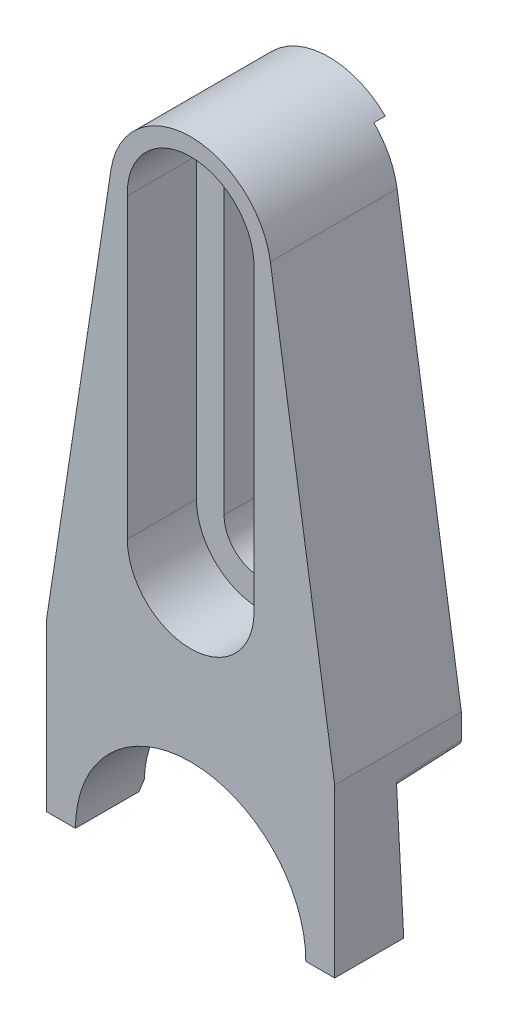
ISO-10303-21;
HEADER;
FILE_DESCRIPTION(('STEP AP214'),'2;1');
FILE_NAME('part.step','',(''),(''),'','','');
FILE_SCHEMA(('AUTOMOTIVE_DESIGN { 1 0 10303 214 1 1 1 1 }'));
ENDSEC;
DATA;
#1=APPLICATION_CONTEXT('core data for automotive mechanical design processes');
#2=APPLICATION_PROTOCOL_DEFINITION('international standard','automotive_design',2000,#1);
#3=PRODUCT_CONTEXT('',#1,'mechanical');
#4=PRODUCT('Part','Part','',(#3));
#5=PRODUCT_RELATED_PRODUCT_CATEGORY('part','',(#4));
#6=PRODUCT_DEFINITION_FORMATION('','',#4);
#7=PRODUCT_DEFINITION_CONTEXT('part definition',#1,'design');
#8=PRODUCT_DEFINITION('design','',#6,#7);
#9=PRODUCT_DEFINITION_SHAPE('','',#8);
#10=(LENGTH_UNIT() NAMED_UNIT(*) SI_UNIT(.MILLI.,.METRE.));
#11=(NAMED_UNIT(*) PLANE_ANGLE_UNIT() SI_UNIT($,.RADIAN.));
#12=(NAMED_UNIT(*) SI_UNIT($,.STERADIAN.) SOLID_ANGLE_UNIT());
#13=UNCERTAINTY_MEASURE_WITH_UNIT(LENGTH_MEASURE(1.E-05),#10,'distance_accuracy_value','');
#14=(GEOMETRIC_REPRESENTATION_CONTEXT(3) GLOBAL_UNCERTAINTY_ASSIGNED_CONTEXT((#13)) GLOBAL_UNIT_ASSIGNED_CONTEXT((#10,
#11,#12)) REPRESENTATION_CONTEXT('',''));
#15=CARTESIAN_POINT('',(0.,0.,0.));
#16=DIRECTION('',(0.,0.,1.));
#17=DIRECTION('',(1.,0.,0.));
#18=AXIS2_PLACEMENT_3D('',#15,#16,#17);
#19=CARTESIAN_POINT('',(17.3989794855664,36.9554074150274,0.));
#20=DIRECTION('',(0.,-1.,0.));
#21=DIRECTION('',(1.,0.,0.));
#22=AXIS2_PLACEMENT_3D('',#19,#20,#21);
#23=PLANE('',#22);
#24=DIRECTION('',(1.,0.,0.));
#25=VECTOR('',#24,1.);
#26=CARTESIAN_POINT('',(7.46367417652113,36.9554074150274,0.));
#27=LINE('',#26,#25);
#28=CARTESIAN_POINT('',(7.60102051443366,36.9554074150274,0.));
#29=VERTEX_POINT('',#28);
#30=CARTESIAN_POINT('',(17.3989794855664,36.9554074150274,0.));
#31=VERTEX_POINT('',#30);
#32=EDGE_CURVE('E206',#29,#31,#27,.T.);
#33=ORIENTED_EDGE('',*,*,#32,.T.);
#34=DIRECTION('',(0.,0.,1.));
#35=VECTOR('',#34,1.);
#36=CARTESIAN_POINT('',(17.3989794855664,36.9554074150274,0.));
#37=LINE('',#36,#35);
#38=CARTESIAN_POINT('',(17.3989794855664,36.9554074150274,1.));
#39=VERTEX_POINT('',#38);
#40=EDGE_CURVE('E376',#31,#39,#37,.T.);
#41=ORIENTED_EDGE('',*,*,#40,.T.);
#42=DIRECTION('',(1.,0.,0.));
#43=VECTOR('',#42,1.);
#44=CARTESIAN_POINT('',(12.5035715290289,36.9554074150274,1.));
#45=LINE('',#44,#43);
#46=CARTESIAN_POINT('',(7.60102051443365,36.9554074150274,1.));
#47=VERTEX_POINT('',#46);
#48=EDGE_CURVE('E215',#39,#47,#45,.F.);
#49=ORIENTED_EDGE('',*,*,#48,.T.);
#50=DIRECTION('',(0.,0.,1.));
#51=VECTOR('',#50,1.);
#52=CARTESIAN_POINT('',(7.60102051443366,36.9554074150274,0.));
#53=LINE('',#52,#51);
#54=EDGE_CURVE('E378',#47,#29,#53,.F.);
#55=ORIENTED_EDGE('',*,*,#54,.T.);
#56=EDGE_LOOP('',(#33,#41,#49,#55));
#57=FACE_BOUND('',#56,.T.);
#58=ADVANCED_FACE('F16',(#57),#23,.T.);
#59=CARTESIAN_POINT('',(15.6,5.95540741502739,12.));
#60=DIRECTION('',(1.,0.,0.));
#61=DIRECTION('',(0.,0.,-1.));
#62=AXIS2_PLACEMENT_3D('',#59,#60,#61);
#63=PLANE('',#62);
#64=DIRECTION('',(0.,0.,-1.));
#65=VECTOR('',#64,1.);
#66=CARTESIAN_POINT('',(15.6,5.95540741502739,12.));
#67=LINE('',#66,#65);
#68=CARTESIAN_POINT('',(15.6,5.95540741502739,0.999999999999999));
#69=VERTEX_POINT('',#68);
#70=CARTESIAN_POINT('',(15.6,5.95540741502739,6.));
#71=VERTEX_POINT('',#70);
#72=EDGE_CURVE('E374',#69,#71,#67,.F.);
#73=ORIENTED_EDGE('',*,*,#72,.T.);
#74=DIRECTION('',(0.,1.,0.));
#75=VECTOR('',#74,1.);
#76=CARTESIAN_POINT('',(15.6,5.95540741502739,6.));
#77=LINE('',#76,#75);
#78=CARTESIAN_POINT('',(15.6,31.7554074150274,6.));
#79=VERTEX_POINT('',#78);
#80=EDGE_CURVE('E200',#71,#79,#77,.T.);
#81=ORIENTED_EDGE('',*,*,#80,.T.);
#82=DIRECTION('',(0.,0.,-1.));
#83=VECTOR('',#82,1.);
#84=CARTESIAN_POINT('',(15.6,31.7554074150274,12.));
#85=LINE('',#84,#83);
#86=CARTESIAN_POINT('',(15.6,31.7554074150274,0.999999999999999));
#87=VERTEX_POINT('',#86);
#88=EDGE_CURVE('E175',#79,#87,#85,.T.);
#89=ORIENTED_EDGE('',*,*,#88,.T.);
#90=DIRECTION('',(0.,1.,0.));
#91=VECTOR('',#90,1.);
#92=CARTESIAN_POINT('',(15.6,6.47202353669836,1.));
#93=LINE('',#92,#91);
#94=EDGE_CURVE('E213',#87,#69,#93,.F.);
#95=ORIENTED_EDGE('',*,*,#94,.T.);
#96=EDGE_LOOP('',(#73,#81,#89,#95));
#97=FACE_BOUND('',#96,.T.);
#98=ADVANCED_FACE('F533',(#97),#63,.F.);
#99=CARTESIAN_POINT('',(12.5,5.95540741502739,12.));
#100=DIRECTION('',(0.,0.,-1.));
#101=DIRECTION('',(-1.,0.,0.));
#102=AXIS2_PLACEMENT_3D('',#99,#100,#101);
#103=CYLINDRICAL_SURFACE('',#102,3.1);
#104=DIRECTION('',(0.,0.,1.));
#105=VECTOR('',#104,1.);
#106=CARTESIAN_POINT('',(9.40000000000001,5.95540741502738,12.));
#107=LINE('',#106,#105);
#108=CARTESIAN_POINT('',(9.4,5.95540741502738,0.999999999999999));
#109=VERTEX_POINT('',#108);
#110=CARTESIAN_POINT('',(9.4,5.95540741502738,6.));
#111=VERTEX_POINT('',#110);
#112=EDGE_CURVE('E190',#109,#111,#107,.T.);
#113=ORIENTED_EDGE('',*,*,#112,.T.);
#114=CARTESIAN_POINT('',(12.5,5.95540741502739,6.));
#115=DIRECTION('',(0.,0.,-1.));
#116=DIRECTION('',(-1.,0.,0.));
#117=AXIS2_PLACEMENT_3D('',#114,#115,#116);
#118=CIRCLE('',#117,3.1);
#119=EDGE_CURVE('E198',#111,#71,#118,.F.);
#120=ORIENTED_EDGE('',*,*,#119,.T.);
#121=ORIENTED_EDGE('',*,*,#72,.F.);
#122=CARTESIAN_POINT('',(12.5,5.95540741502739,0.999999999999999));
#123=DIRECTION('',(0.,0.,-1.));
#124=DIRECTION('',(-1.,0.,0.));
#125=AXIS2_PLACEMENT_3D('',#122,#123,#124);
#126=CIRCLE('',#125,3.1);
#127=EDGE_CURVE('E212',#69,#109,#126,.T.);
#128=ORIENTED_EDGE('',*,*,#127,.T.);
#129=EDGE_LOOP('',(#113,#120,#121,#128));
#130=FACE_BOUND('',#129,.T.);
#131=ADVANCED_FACE('F530',(#130),#103,.F.);
#132=CARTESIAN_POINT('',(9.4,31.7554074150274,12.));
#133=DIRECTION('',(-1.,0.,0.));
#134=DIRECTION('',(0.,-1.,0.));
#135=AXIS2_PLACEMENT_3D('',#132,#133,#134);
#136=PLANE('',#135);
#137=DIRECTION('',(0.,0.,-1.));
#138=VECTOR('',#137,1.);
#139=CARTESIAN_POINT('',(9.4,31.7554074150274,12.));
#140=LINE('',#139,#138);
#141=CARTESIAN_POINT('',(9.4,31.7554074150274,0.999999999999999));
#142=VERTEX_POINT('',#141);
#143=CARTESIAN_POINT('',(9.4,31.7554074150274,6.));
#144=VERTEX_POINT('',#143);
#145=EDGE_CURVE('E181',#142,#144,#140,.F.);
#146=ORIENTED_EDGE('',*,*,#145,.T.);
#147=DIRECTION('',(0.,1.,0.));
#148=VECTOR('',#147,1.);
#149=CARTESIAN_POINT('',(9.4,5.95540741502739,6.));
#150=LINE('',#149,#148);
#151=EDGE_CURVE('E185',#144,#111,#150,.F.);
#152=ORIENTED_EDGE('',*,*,#151,.T.);
#153=ORIENTED_EDGE('',*,*,#112,.F.);
#154=DIRECTION('',(0.,1.,0.));
#155=VECTOR('',#154,1.);
#156=CARTESIAN_POINT('',(9.4,6.47202353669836,1.));
#157=LINE('',#156,#155);
#158=EDGE_CURVE('E188',#109,#142,#157,.T.);
#159=ORIENTED_EDGE('',*,*,#158,.T.);
#160=EDGE_LOOP('',(#146,#152,#153,#159));
#161=FACE_BOUND('',#160,.T.);
#162=ADVANCED_FACE('F182',(#161),#136,.F.);
#163=CARTESIAN_POINT('',(12.5,31.7554074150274,12.));
#164=DIRECTION('',(0.,0.,-1.));
#165=DIRECTION('',(-1.,0.,0.));
#166=AXIS2_PLACEMENT_3D('',#163,#164,#165);
#167=CYLINDRICAL_SURFACE('',#166,3.1);
#168=ORIENTED_EDGE('',*,*,#88,.F.);
#169=CARTESIAN_POINT('',(12.5,31.7554074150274,6.));
#170=DIRECTION('',(0.,0.,-1.));
#171=DIRECTION('',(-1.,0.,0.));
#172=AXIS2_PLACEMENT_3D('',#169,#170,#171);
#173=CIRCLE('',#172,3.1);
#174=EDGE_CURVE('E20',#79,#144,#173,.F.);
#175=ORIENTED_EDGE('',*,*,#174,.T.);
#176=ORIENTED_EDGE('',*,*,#145,.F.);
#177=CARTESIAN_POINT('',(12.5,31.7554074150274,0.999999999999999));
#178=DIRECTION('',(0.,0.,-1.));
#179=DIRECTION('',(-1.,0.,0.));
#180=AXIS2_PLACEMENT_3D('',#177,#178,#179);
#181=CIRCLE('',#180,3.1);
#182=EDGE_CURVE('E211',#142,#87,#181,.T.);
#183=ORIENTED_EDGE('',*,*,#182,.T.);
#184=EDGE_LOOP('',(#168,#175,#176,#183));
#185=FACE_BOUND('',#184,.T.);
#186=ADVANCED_FACE('F193',(#185),#167,.F.);
#187=CARTESIAN_POINT('',(12.5,-17.7050585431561,1.0177942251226));
#188=DIRECTION('',(0.,0.052335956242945,-0.998629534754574));
#189=DIRECTION('',(0.,0.998629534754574,0.052335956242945));
#190=AXIS2_PLACEMENT_3D('',#187,#188,#189);
#191=CYLINDRICAL_SURFACE('',#190,16.5);
#192=CARTESIAN_POINT('',(12.5,-17.7041259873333,1.));
#193=DIRECTION('',(0.,0.,1.));
#194=DIRECTION('',(0.,1.,0.));
#195=AXIS2_PLACEMENT_3D('',#192,#193,#194);
#196=ELLIPSE('',#195,16.5226437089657,16.5);
#197=CARTESIAN_POINT('',(0.852941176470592,-6.00065675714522,1.));
#198=VERTEX_POINT('',#197);
#199=CARTESIAN_POINT('',(24.1470588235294,-6.00065675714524,1.));
#200=VERTEX_POINT('',#199);
#201=EDGE_CURVE('E209',#198,#200,#196,.F.);
#202=ORIENTED_EDGE('',*,*,#201,.T.);
#203=DIRECTION('',(0.,0.052335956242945,-0.998629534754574));
#204=VECTOR('',#203,1.);
#205=CARTESIAN_POINT('',(24.1470588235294,-6.03364572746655,1.62946705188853));
#206=LINE('',#205,#204);
#207=CARTESIAN_POINT('',(24.1470588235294,-6.29506382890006,6.61762157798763));
#208=VERTEX_POINT('',#207);
#209=EDGE_CURVE('E203',#208,#200,#206,.T.);
#210=ORIENTED_EDGE('',*,*,#209,.F.);
#211=CARTESIAN_POINT('',(12.5,-17.9664766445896,6.0059487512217));
#212=DIRECTION('',(0.,0.052335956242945,-0.998629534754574));
#213=DIRECTION('',(0.,0.998629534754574,0.052335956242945));
#214=AXIS2_PLACEMENT_3D('',#211,#212,#213);
#215=CIRCLE('',#214,16.5);
#216=CARTESIAN_POINT('',(0.852941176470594,-6.29506382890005,6.61762157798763));
#217=VERTEX_POINT('',#216);
#218=EDGE_CURVE('E402',#208,#217,#215,.F.);
#219=ORIENTED_EDGE('',*,*,#218,.T.);
#220=DIRECTION('',(0.,-0.052335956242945,0.998629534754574));
#221=VECTOR('',#220,1.);
#222=CARTESIAN_POINT('',(0.852941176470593,-6.03364572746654,1.62946705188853));
#223=LINE('',#222,#221);
#224=EDGE_CURVE('E219',#198,#217,#223,.T.);
#225=ORIENTED_EDGE('',*,*,#224,.F.);
#226=EDGE_LOOP('',(#202,#210,#219,#225));
#227=FACE_BOUND('',#226,.T.);
#228=ADVANCED_FACE('F413',(#227),#191,.F.);
#229=CARTESIAN_POINT('',(12.5,5.95540741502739,6.));
#230=DIRECTION('',(0.,0.,-1.));
#231=DIRECTION('',(-1.,0.,0.));
#232=AXIS2_PLACEMENT_3D('',#229,#230,#231);
#233=PLANE('',#232);
#234=DIRECTION('',(0.,1.,0.));
#235=VECTOR('',#234,1.);
#236=CARTESIAN_POINT('',(18.,5.95540741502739,6.));
#237=LINE('',#236,#235);
#238=CARTESIAN_POINT('',(18.,5.95540741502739,6.));
#239=VERTEX_POINT('',#238);
#240=CARTESIAN_POINT('',(18.,31.7554074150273,6.));
#241=VERTEX_POINT('',#240);
#242=EDGE_CURVE('E226',#239,#241,#237,.T.);
#243=ORIENTED_EDGE('',*,*,#242,.T.);
#244=CARTESIAN_POINT('',(12.5,31.9554074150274,6.));
#245=DIRECTION('',(0.,0.,-1.));
#246=DIRECTION('',(-1.,0.,0.));
#247=AXIS2_PLACEMENT_3D('',#244,#245,#246);
#248=CIRCLE('',#247,5.50363516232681);
#249=CARTESIAN_POINT('',(7.,31.7554074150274,6.));
#250=VERTEX_POINT('',#249);
#251=EDGE_CURVE('E315',#241,#250,#248,.F.);
#252=ORIENTED_EDGE('',*,*,#251,.T.);
#253=DIRECTION('',(0.,-1.,0.));
#254=VECTOR('',#253,1.);
#255=CARTESIAN_POINT('',(7.,31.7554074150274,6.));
#256=LINE('',#255,#254);
#257=CARTESIAN_POINT('',(7.,5.95540741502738,6.));
#258=VERTEX_POINT('',#257);
#259=EDGE_CURVE('E319',#250,#258,#256,.T.);
#260=ORIENTED_EDGE('',*,*,#259,.T.);
#261=CARTESIAN_POINT('',(12.5,5.95540741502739,6.));
#262=DIRECTION('',(0.,0.,-1.));
#263=DIRECTION('',(-1.,0.,0.));
#264=AXIS2_PLACEMENT_3D('',#261,#262,#263);
#265=CIRCLE('',#264,5.5);
#266=EDGE_CURVE('E324',#258,#239,#265,.F.);
#267=ORIENTED_EDGE('',*,*,#266,.T.);
#268=EDGE_LOOP('',(#243,#252,#260,#267));
#269=FACE_BOUND('',#268,.T.);
#270=ORIENTED_EDGE('',*,*,#119,.F.);
#271=ORIENTED_EDGE('',*,*,#151,.F.);
#272=ORIENTED_EDGE('',*,*,#174,.F.);
#273=ORIENTED_EDGE('',*,*,#80,.F.);
#274=EDGE_LOOP('',(#270,#271,#272,#273));
#275=FACE_BOUND('',#274,.T.);
#276=ADVANCED_FACE('F196',(#269,#275),#233,.F.);
#277=CARTESIAN_POINT('',(22.7003481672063,-18.5566115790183,6.66624437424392));
#278=DIRECTION('',(0.500000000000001,0.462307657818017,0.732305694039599));
#279=DIRECTION('',(0.825859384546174,0.,-0.563876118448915));
#280=AXIS2_PLACEMENT_3D('',#277,#278,#279);
#281=PLANE('',#280);
#282=DIRECTION('',(0.825859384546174,0.,-0.563876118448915));
#283=VECTOR('',#282,1.);
#284=CARTESIAN_POINT('',(22.5,-18.0445925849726,6.47979734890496));
#285=LINE('',#284,#283);
#286=CARTESIAN_POINT('',(22.5,-18.0445925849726,6.47979734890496));
#287=VERTEX_POINT('',#286);
#288=CARTESIAN_POINT('',(23.2,-18.0445925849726,6.00185486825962));
#289=VERTEX_POINT('',#288);
#290=EDGE_CURVE('E361',#287,#289,#285,.T.);
#291=ORIENTED_EDGE('',*,*,#290,.F.);
#292=CARTESIAN_POINT('',(12.5,-18.0445925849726,13.30754707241));
#293=DIRECTION('',(0.500000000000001,0.462307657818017,0.732305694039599));
#294=DIRECTION('',(0.53768829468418,0.497154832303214,-0.680976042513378));
#295=AXIS2_PLACEMENT_3D('',#292,#293,#294);
#296=ELLIPSE('',#295,13.65549944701,10.);
#297=CARTESIAN_POINT('',(22.4736589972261,-17.3192470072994,6.03986861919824));
#298=VERTEX_POINT('',#297);
#299=EDGE_CURVE('E314',#287,#298,#296,.T.);
#300=ORIENTED_EDGE('',*,*,#299,.T.);
#301=DIRECTION('',(0.70710678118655,-0.706137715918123,-0.0370071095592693));
#302=VECTOR('',#301,1.);
#303=CARTESIAN_POINT('',(22.4736589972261,-17.3192470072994,6.03986861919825));
#304=LINE('',#303,#302);
#305=EDGE_CURVE('E222',#298,#289,#304,.T.);
#306=ORIENTED_EDGE('',*,*,#305,.T.);
#307=EDGE_LOOP('',(#291,#300,#306));
#308=FACE_BOUND('',#307,.T.);
#309=ADVANCED_FACE('F518',(#308),#281,.F.);
#310=CARTESIAN_POINT('',(24.5,-5.67996655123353,1.64800259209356));
#311=DIRECTION('',(0.,0.052335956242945,-0.998629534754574));
#312=DIRECTION('',(0.,0.998629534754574,0.052335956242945));
#313=AXIS2_PLACEMENT_3D('',#310,#311,#312);
#314=CYLINDRICAL_SURFACE('',#313,0.5);
#315=CARTESIAN_POINT('',(24.5,-5.94138465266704,6.63615711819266));
#316=DIRECTION('',(0.,0.052335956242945,-0.998629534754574));
#317=DIRECTION('',(0.,0.998629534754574,0.052335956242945));
#318=AXIS2_PLACEMENT_3D('',#315,#316,#317);
#319=CIRCLE('',#318,0.5);
#320=CARTESIAN_POINT('',(25.,-5.94138465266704,6.63615711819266));
#321=VERTEX_POINT('',#320);
#322=EDGE_CURVE('E231',#321,#208,#319,.T.);
#323=ORIENTED_EDGE('',*,*,#322,.T.);
#324=ORIENTED_EDGE('',*,*,#209,.T.);
#325=CARTESIAN_POINT('',(24.5,-5.64600617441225,1.));
#326=DIRECTION('',(0.,0.,1.));
#327=DIRECTION('',(0.,1.,0.));
#328=AXIS2_PLACEMENT_3D('',#325,#326,#327);
#329=ELLIPSE('',#328,0.50068617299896,0.5);
#330=CARTESIAN_POINT('',(25.,-5.64600617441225,1.));
#331=VERTEX_POINT('',#330);
#332=EDGE_CURVE('E218',#200,#331,#329,.T.);
#333=ORIENTED_EDGE('',*,*,#332,.T.);
#334=DIRECTION('',(0.,0.052335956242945,-0.998629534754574));
#335=VECTOR('',#334,1.);
#336=CARTESIAN_POINT('',(25.,-5.94138465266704,6.63615711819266));
#337=LINE('',#336,#335);
#338=EDGE_CURVE('E310',#321,#331,#337,.T.);
#339=ORIENTED_EDGE('',*,*,#338,.F.);
#340=EDGE_LOOP('',(#323,#324,#333,#339));
#341=FACE_BOUND('',#340,.T.);
#342=ADVANCED_FACE('F417',(#341),#314,.T.);
#343=CARTESIAN_POINT('',(7.46367417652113,8.58424500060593,0.));
#344=DIRECTION('',(0.,0.,1.));
#345=DIRECTION('',(1.,0.,0.));
#346=AXIS2_PLACEMENT_3D('',#343,#344,#345);
#347=PLANE('',#346);
#348=CARTESIAN_POINT('',(12.5,31.9554074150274,0.));
#349=DIRECTION('',(0.,0.,1.));
#350=DIRECTION('',(1.,0.,0.));
#351=AXIS2_PLACEMENT_3D('',#348,#349,#350);
#352=CIRCLE('',#351,7.);
#353=EDGE_CURVE('E344',#31,#29,#352,.T.);
#354=ORIENTED_EDGE('',*,*,#353,.F.);
#355=ORIENTED_EDGE('',*,*,#32,.F.);
#356=EDGE_LOOP('',(#354,#355));
#357=FACE_BOUND('',#356,.T.);
#358=ADVANCED_FACE('F511',(#357),#347,.F.);
#359=CARTESIAN_POINT('',(12.5035715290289,6.47202353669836,1.));
#360=DIRECTION('',(0.,0.,1.));
#361=DIRECTION('',(1.,0.,0.));
#362=AXIS2_PLACEMENT_3D('',#359,#360,#361);
#363=PLANE('',#362);
#364=ORIENTED_EDGE('',*,*,#158,.F.);
#365=ORIENTED_EDGE('',*,*,#127,.F.);
#366=ORIENTED_EDGE('',*,*,#94,.F.);
#367=ORIENTED_EDGE('',*,*,#182,.F.);
#368=EDGE_LOOP('',(#364,#365,#366,#367));
#369=FACE_BOUND('',#368,.T.);
#370=DIRECTION('',(0.,1.,0.));
#371=VECTOR('',#370,1.);
#372=CARTESIAN_POINT('',(0.,-18.0445925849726,1.));
#373=LINE('',#372,#371);
#374=CARTESIAN_POINT('',(0.,-3.54459258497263,1.));
#375=VERTEX_POINT('',#374);
#376=CARTESIAN_POINT('',(0.,-5.64600617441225,1.));
#377=VERTEX_POINT('',#376);
#378=EDGE_CURVE('E277',#375,#377,#373,.F.);
#379=ORIENTED_EDGE('',*,*,#378,.F.);
#380=DIRECTION('',(-0.150897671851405,-0.98854938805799,0.));
#381=VECTOR('',#380,1.);
#382=CARTESIAN_POINT('',(0.,-3.54459258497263,1.));
#383=LINE('',#382,#381);
#384=CARTESIAN_POINT('',(5.58015428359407,33.0116911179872,1.));
#385=VERTEX_POINT('',#384);
#386=EDGE_CURVE('E284',#385,#375,#383,.T.);
#387=ORIENTED_EDGE('',*,*,#386,.F.);
#388=CARTESIAN_POINT('',(12.5,31.9554074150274,1.));
#389=DIRECTION('',(0.,0.,1.));
#390=DIRECTION('',(1.,0.,0.));
#391=AXIS2_PLACEMENT_3D('',#388,#389,#390);
#392=CIRCLE('',#391,7.);
#393=EDGE_CURVE('E289',#47,#385,#392,.T.);
#394=ORIENTED_EDGE('',*,*,#393,.F.);
#395=ORIENTED_EDGE('',*,*,#48,.F.);
#396=CARTESIAN_POINT('',(12.5,31.9554074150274,1.));
#397=DIRECTION('',(0.,0.,1.));
#398=DIRECTION('',(1.,0.,0.));
#399=AXIS2_PLACEMENT_3D('',#396,#397,#398);
#400=CIRCLE('',#399,7.);
#401=CARTESIAN_POINT('',(19.4198457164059,33.0116911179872,1.));
#402=VERTEX_POINT('',#401);
#403=EDGE_CURVE('E288',#402,#39,#400,.T.);
#404=ORIENTED_EDGE('',*,*,#403,.F.);
#405=DIRECTION('',(-0.150897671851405,0.98854938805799,0.));
#406=VECTOR('',#405,1.);
#407=CARTESIAN_POINT('',(25.,-3.54459258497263,1.));
#408=LINE('',#407,#406);
#409=CARTESIAN_POINT('',(25.,-3.54459258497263,1.));
#410=VERTEX_POINT('',#409);
#411=EDGE_CURVE('E293',#410,#402,#408,.T.);
#412=ORIENTED_EDGE('',*,*,#411,.F.);
#413=DIRECTION('',(0.,1.,0.));
#414=VECTOR('',#413,1.);
#415=CARTESIAN_POINT('',(25.,-18.0445925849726,1.));
#416=LINE('',#415,#414);
#417=EDGE_CURVE('E304',#331,#410,#416,.T.);
#418=ORIENTED_EDGE('',*,*,#417,.F.);
#419=ORIENTED_EDGE('',*,*,#332,.F.);
#420=ORIENTED_EDGE('',*,*,#201,.F.);
#421=CARTESIAN_POINT('',(0.500000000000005,-5.64600617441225,1.));
#422=DIRECTION('',(0.,0.,1.));
#423=DIRECTION('',(0.,-1.,0.));
#424=AXIS2_PLACEMENT_3D('',#421,#422,#423);
#425=ELLIPSE('',#424,0.50068617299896,0.5);
#426=EDGE_CURVE('E223',#377,#198,#425,.T.);
#427=ORIENTED_EDGE('',*,*,#426,.F.);
#428=EDGE_LOOP('',(#379,#387,#394,#395,#404,#412,#418,#419,#420,#427));
#429=FACE_BOUND('',#428,.T.);
#430=ADVANCED_FACE('F422',(#369,#429),#363,.F.);
#431=CARTESIAN_POINT('',(0.500000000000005,-5.67996655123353,1.64800259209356));
#432=DIRECTION('',(0.,-0.052335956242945,0.998629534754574));
#433=DIRECTION('',(0.,-0.998629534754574,-0.052335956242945));
#434=AXIS2_PLACEMENT_3D('',#431,#432,#433);
#435=CYLINDRICAL_SURFACE('',#434,0.5);
#436=CARTESIAN_POINT('',(0.500000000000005,-5.94138465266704,6.63615711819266));
#437=DIRECTION('',(0.,-0.052335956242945,0.998629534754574));
#438=DIRECTION('',(0.,-0.998629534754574,-0.052335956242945));
#439=AXIS2_PLACEMENT_3D('',#436,#437,#438);
#440=CIRCLE('',#439,0.5);
#441=CARTESIAN_POINT('',(0.,-5.94138465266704,6.63615711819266));
#442=VERTEX_POINT('',#441);
#443=EDGE_CURVE('E227',#217,#442,#440,.F.);
#444=ORIENTED_EDGE('',*,*,#443,.T.);
#445=DIRECTION('',(0.,-0.052335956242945,0.998629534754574));
#446=VECTOR('',#445,1.);
#447=CARTESIAN_POINT('',(0.,-5.64600617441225,1.));
#448=LINE('',#447,#446);
#449=EDGE_CURVE('E334',#377,#442,#448,.T.);
#450=ORIENTED_EDGE('',*,*,#449,.F.);
#451=ORIENTED_EDGE('',*,*,#426,.T.);
#452=ORIENTED_EDGE('',*,*,#224,.T.);
#453=EDGE_LOOP('',(#444,#450,#451,#452));
#454=FACE_BOUND('',#453,.T.);
#455=ADVANCED_FACE('F434',(#454),#435,.T.);
#456=CARTESIAN_POINT('',(2.29965183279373,-18.5566115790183,6.66624437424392));
#457=DIRECTION('',(-0.500000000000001,0.462307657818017,0.732305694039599));
#458=DIRECTION('',(0.825859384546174,0.,0.563876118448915));
#459=AXIS2_PLACEMENT_3D('',#456,#457,#458);
#460=PLANE('',#459);
#461=CARTESIAN_POINT('',(12.5,-18.0445925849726,13.30754707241));
#462=DIRECTION('',(-0.500000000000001,0.462307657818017,0.732305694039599));
#463=DIRECTION('',(-0.53768829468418,0.497154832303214,-0.680976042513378));
#464=AXIS2_PLACEMENT_3D('',#461,#462,#463);
#465=ELLIPSE('',#464,13.65549944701,10.);
#466=CARTESIAN_POINT('',(2.52634100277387,-17.3192470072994,6.03986861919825));
#467=VERTEX_POINT('',#466);
#468=CARTESIAN_POINT('',(2.5,-18.0445925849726,6.47979734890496));
#469=VERTEX_POINT('',#468);
#470=EDGE_CURVE('E366',#467,#469,#465,.T.);
#471=ORIENTED_EDGE('',*,*,#470,.T.);
#472=DIRECTION('',(0.825859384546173,0.,0.563876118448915));
#473=VECTOR('',#472,1.);
#474=CARTESIAN_POINT('',(1.80000000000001,-18.0445925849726,6.00185486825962));
#475=LINE('',#474,#473);
#476=CARTESIAN_POINT('',(1.8,-18.0445925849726,6.00185486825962));
#477=VERTEX_POINT('',#476);
#478=EDGE_CURVE('E266',#477,#469,#475,.T.);
#479=ORIENTED_EDGE('',*,*,#478,.F.);
#480=DIRECTION('',(0.707106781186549,0.706137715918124,0.0370071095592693));
#481=VECTOR('',#480,1.);
#482=CARTESIAN_POINT('',(1.80000000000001,-18.0445925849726,6.00185486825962));
#483=LINE('',#482,#481);
#484=EDGE_CURVE('E224',#477,#467,#483,.T.);
#485=ORIENTED_EDGE('',*,*,#484,.T.);
#486=EDGE_LOOP('',(#471,#479,#485));
#487=FACE_BOUND('',#486,.T.);
#488=ADVANCED_FACE('F465',(#487),#460,.F.);
#489=CARTESIAN_POINT('',(12.5,-17.9664766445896,6.0059487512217));
#490=DIRECTION('',(0.,-0.0523359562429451,0.998629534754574));
#491=DIRECTION('',(0.,-0.998629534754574,-0.0523359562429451));
#492=AXIS2_PLACEMENT_3D('',#489,#490,#491);
#493=PLANE('',#492);
#494=DIRECTION('',(1.,0.,0.));
#495=VECTOR('',#494,1.);
#496=CARTESIAN_POINT('',(12.5,-18.0445925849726,6.00185486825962));
#497=LINE('',#496,#495);
#498=CARTESIAN_POINT('',(0.,-18.0445925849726,6.00185486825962));
#499=VERTEX_POINT('',#498);
#500=EDGE_CURVE('E262',#499,#477,#497,.T.);
#501=ORIENTED_EDGE('',*,*,#500,.F.);
#502=DIRECTION('',(0.,-0.998629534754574,-0.0523359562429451));
#503=VECTOR('',#502,1.);
#504=CARTESIAN_POINT('',(0.,-5.94138465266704,6.63615711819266));
#505=LINE('',#504,#503);
#506=EDGE_CURVE('E278',#442,#499,#505,.T.);
#507=ORIENTED_EDGE('',*,*,#506,.F.);
#508=ORIENTED_EDGE('',*,*,#443,.F.);
#509=ORIENTED_EDGE('',*,*,#218,.F.);
#510=ORIENTED_EDGE('',*,*,#322,.F.);
#511=DIRECTION('',(0.,0.998629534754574,0.0523359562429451));
#512=VECTOR('',#511,1.);
#513=CARTESIAN_POINT('',(25.,-18.0445925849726,6.00185486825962));
#514=LINE('',#513,#512);
#515=CARTESIAN_POINT('',(25.,-18.0445925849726,6.00185486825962));
#516=VERTEX_POINT('',#515);
#517=EDGE_CURVE('E303',#516,#321,#514,.T.);
#518=ORIENTED_EDGE('',*,*,#517,.F.);
#519=DIRECTION('',(1.,0.,0.));
#520=VECTOR('',#519,1.);
#521=CARTESIAN_POINT('',(12.5,-18.0445925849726,6.00185486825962));
#522=LINE('',#521,#520);
#523=EDGE_CURVE('E311',#289,#516,#522,.T.);
#524=ORIENTED_EDGE('',*,*,#523,.F.);
#525=ORIENTED_EDGE('',*,*,#305,.F.);
#526=CARTESIAN_POINT('',(12.5,-18.0445925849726,6.00185486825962));
#527=DIRECTION('',(0.,-0.0523359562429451,0.998629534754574));
#528=DIRECTION('',(0.,-0.998629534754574,-0.0523359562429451));
#529=AXIS2_PLACEMENT_3D('',#526,#527,#528);
#530=ELLIPSE('',#529,10.0137234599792,10.);
#531=EDGE_CURVE('E395',#298,#467,#530,.T.);
#532=ORIENTED_EDGE('',*,*,#531,.T.);
#533=ORIENTED_EDGE('',*,*,#484,.F.);
#534=EDGE_LOOP('',(#501,#507,#508,#509,#510,#518,#524,#525,#532,#533));
#535=FACE_BOUND('',#534,.T.);
#536=ADVANCED_FACE('F429',(#535),#493,.F.);
#537=CARTESIAN_POINT('',(18.,5.95540741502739,12.));
#538=DIRECTION('',(1.,0.,0.));
#539=DIRECTION('',(0.,0.,-1.));
#540=AXIS2_PLACEMENT_3D('',#537,#538,#539);
#541=PLANE('',#540);
#542=DIRECTION('',(0.,0.,-1.));
#543=VECTOR('',#542,1.);
#544=CARTESIAN_POINT('',(18.,5.95540741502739,12.));
#545=LINE('',#544,#543);
#546=CARTESIAN_POINT('',(18.,5.95540741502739,12.));
#547=VERTEX_POINT('',#546);
#548=EDGE_CURVE('E322',#239,#547,#545,.F.);
#549=ORIENTED_EDGE('',*,*,#548,.T.);
#550=DIRECTION('',(0.,1.,0.));
#551=VECTOR('',#550,1.);
#552=CARTESIAN_POINT('',(18.,8.58424500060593,12.));
#553=LINE('',#552,#551);
#554=CARTESIAN_POINT('',(18.,31.7554074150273,12.));
#555=VERTEX_POINT('',#554);
#556=EDGE_CURVE('E259',#555,#547,#553,.F.);
#557=ORIENTED_EDGE('',*,*,#556,.F.);
#558=DIRECTION('',(0.,0.,-1.));
#559=VECTOR('',#558,1.);
#560=CARTESIAN_POINT('',(18.,31.7554074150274,12.));
#561=LINE('',#560,#559);
#562=EDGE_CURVE('E316',#555,#241,#561,.T.);
#563=ORIENTED_EDGE('',*,*,#562,.T.);
#564=ORIENTED_EDGE('',*,*,#242,.F.);
#565=EDGE_LOOP('',(#549,#557,#563,#564));
#566=FACE_BOUND('',#565,.T.);
#567=ADVANCED_FACE('F498',(#566),#541,.F.);
#568=CARTESIAN_POINT('',(12.5,5.95540741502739,12.));
#569=DIRECTION('',(0.,0.,-1.));
#570=DIRECTION('',(-1.,0.,0.));
#571=AXIS2_PLACEMENT_3D('',#568,#569,#570);
#572=CYLINDRICAL_SURFACE('',#571,5.5);
#573=CARTESIAN_POINT('',(12.5,5.95540741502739,12.));
#574=DIRECTION('',(0.,0.,-1.));
#575=DIRECTION('',(-1.,0.,0.));
#576=AXIS2_PLACEMENT_3D('',#573,#574,#575);
#577=CIRCLE('',#576,5.5);
#578=CARTESIAN_POINT('',(7.,5.95540741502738,12.));
#579=VERTEX_POINT('',#578);
#580=EDGE_CURVE('E258',#547,#579,#577,.T.);
#581=ORIENTED_EDGE('',*,*,#580,.F.);
#582=ORIENTED_EDGE('',*,*,#548,.F.);
#583=ORIENTED_EDGE('',*,*,#266,.F.);
#584=DIRECTION('',(0.,0.,1.));
#585=VECTOR('',#584,1.);
#586=CARTESIAN_POINT('',(7.,5.95540741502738,12.));
#587=LINE('',#586,#585);
#588=EDGE_CURVE('E320',#258,#579,#587,.T.);
#589=ORIENTED_EDGE('',*,*,#588,.T.);
#590=EDGE_LOOP('',(#581,#582,#583,#589));
#591=FACE_BOUND('',#590,.T.);
#592=ADVANCED_FACE('F494',(#591),#572,.F.);
#593=CARTESIAN_POINT('',(7.,31.7554074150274,12.));
#594=DIRECTION('',(-1.,0.,0.));
#595=DIRECTION('',(0.,-1.,0.));
#596=AXIS2_PLACEMENT_3D('',#593,#594,#595);
#597=PLANE('',#596);
#598=DIRECTION('',(0.,0.,-1.));
#599=VECTOR('',#598,1.);
#600=CARTESIAN_POINT('',(7.,31.7554074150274,12.));
#601=LINE('',#600,#599);
#602=CARTESIAN_POINT('',(7.,31.7554074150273,12.));
#603=VERTEX_POINT('',#602);
#604=EDGE_CURVE('E312',#250,#603,#601,.F.);
#605=ORIENTED_EDGE('',*,*,#604,.T.);
#606=DIRECTION('',(0.,1.,0.));
#607=VECTOR('',#606,1.);
#608=CARTESIAN_POINT('',(7.,8.58424500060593,12.));
#609=LINE('',#608,#607);
#610=EDGE_CURVE('E254',#579,#603,#609,.T.);
#611=ORIENTED_EDGE('',*,*,#610,.F.);
#612=ORIENTED_EDGE('',*,*,#588,.F.);
#613=ORIENTED_EDGE('',*,*,#259,.F.);
#614=EDGE_LOOP('',(#605,#611,#612,#613));
#615=FACE_BOUND('',#614,.T.);
#616=ADVANCED_FACE('F490',(#615),#597,.F.);
#617=CARTESIAN_POINT('',(12.5,31.9554074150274,12.));
#618=DIRECTION('',(0.,0.,-1.));
#619=DIRECTION('',(-1.,0.,0.));
#620=AXIS2_PLACEMENT_3D('',#617,#618,#619);
#621=CYLINDRICAL_SURFACE('',#620,5.50363516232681);
#622=ORIENTED_EDGE('',*,*,#251,.F.);
#623=ORIENTED_EDGE('',*,*,#562,.F.);
#624=CARTESIAN_POINT('',(12.5,31.9554074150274,12.));
#625=DIRECTION('',(0.,0.,-1.));
#626=DIRECTION('',(-1.,0.,0.));
#627=AXIS2_PLACEMENT_3D('',#624,#625,#626);
#628=CIRCLE('',#627,5.50363516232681);
#629=EDGE_CURVE('E257',#603,#555,#628,.T.);
#630=ORIENTED_EDGE('',*,*,#629,.F.);
#631=ORIENTED_EDGE('',*,*,#604,.F.);
#632=EDGE_LOOP('',(#622,#623,#630,#631));
#633=FACE_BOUND('',#632,.T.);
#634=ADVANCED_FACE('F487',(#633),#621,.F.);
#635=CARTESIAN_POINT('',(12.5,-18.0445925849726,12.));
#636=DIRECTION('',(0.,0.,-1.));
#637=DIRECTION('',(-1.,0.,0.));
#638=AXIS2_PLACEMENT_3D('',#635,#636,#637);
#639=CYLINDRICAL_SURFACE('',#638,10.);
#640=ORIENTED_EDGE('',*,*,#531,.F.);
#641=ORIENTED_EDGE('',*,*,#299,.F.);
#642=DIRECTION('',(0.,0.,1.));
#643=VECTOR('',#642,1.);
#644=CARTESIAN_POINT('',(22.5,-18.0445925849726,0.));
#645=LINE('',#644,#643);
#646=CARTESIAN_POINT('',(22.5,-18.0445925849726,12.));
#647=VERTEX_POINT('',#646);
#648=EDGE_CURVE('E307',#647,#287,#645,.F.);
#649=ORIENTED_EDGE('',*,*,#648,.F.);
#650=CARTESIAN_POINT('',(12.5,-18.0445925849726,12.));
#651=DIRECTION('',(0.,0.,-1.));
#652=DIRECTION('',(-1.,0.,0.));
#653=AXIS2_PLACEMENT_3D('',#650,#651,#652);
#654=CIRCLE('',#653,10.);
#655=CARTESIAN_POINT('',(2.5,-18.0445925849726,12.));
#656=VERTEX_POINT('',#655);
#657=EDGE_CURVE('E251',#656,#647,#654,.T.);
#658=ORIENTED_EDGE('',*,*,#657,.F.);
#659=DIRECTION('',(0.,0.,1.));
#660=VECTOR('',#659,1.);
#661=CARTESIAN_POINT('',(2.5,-18.0445925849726,0.));
#662=LINE('',#661,#660);
#663=EDGE_CURVE('E263',#469,#656,#662,.T.);
#664=ORIENTED_EDGE('',*,*,#663,.F.);
#665=ORIENTED_EDGE('',*,*,#470,.F.);
#666=EDGE_LOOP('',(#640,#641,#649,#658,#664,#665));
#667=FACE_BOUND('',#666,.T.);
#668=ADVANCED_FACE('F462',(#667),#639,.F.);
#669=CARTESIAN_POINT('',(12.5,-18.0445925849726,0.));
#670=DIRECTION('',(0.,-1.,0.));
#671=DIRECTION('',(1.,0.,0.));
#672=AXIS2_PLACEMENT_3D('',#669,#670,#671);
#673=PLANE('',#672);
#674=DIRECTION('',(1.,0.,0.));
#675=VECTOR('',#674,1.);
#676=CARTESIAN_POINT('',(7.46367417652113,-18.0445925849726,12.));
#677=LINE('',#676,#675);
#678=CARTESIAN_POINT('',(25.,-18.0445925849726,12.));
#679=VERTEX_POINT('',#678);
#680=EDGE_CURVE('E248',#647,#679,#677,.T.);
#681=ORIENTED_EDGE('',*,*,#680,.F.);
#682=ORIENTED_EDGE('',*,*,#648,.T.);
#683=ORIENTED_EDGE('',*,*,#290,.T.);
#684=ORIENTED_EDGE('',*,*,#523,.T.);
#685=DIRECTION('',(0.,0.,-1.));
#686=VECTOR('',#685,1.);
#687=CARTESIAN_POINT('',(25.,-18.0445925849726,0.));
#688=LINE('',#687,#686);
#689=EDGE_CURVE('E300',#679,#516,#688,.T.);
#690=ORIENTED_EDGE('',*,*,#689,.F.);
#691=EDGE_LOOP('',(#681,#682,#683,#684,#690));
#692=FACE_BOUND('',#691,.T.);
#693=ADVANCED_FACE('F454',(#692),#673,.T.);
#694=CARTESIAN_POINT('',(25.,-18.0445925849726,0.));
#695=DIRECTION('',(1.,0.,0.));
#696=DIRECTION('',(0.,0.,-1.));
#697=AXIS2_PLACEMENT_3D('',#694,#695,#696);
#698=PLANE('',#697);
#699=ORIENTED_EDGE('',*,*,#689,.T.);
#700=ORIENTED_EDGE('',*,*,#517,.T.);
#701=ORIENTED_EDGE('',*,*,#338,.T.);
#702=ORIENTED_EDGE('',*,*,#417,.T.);
#703=DIRECTION('',(0.,0.,1.));
#704=VECTOR('',#703,1.);
#705=CARTESIAN_POINT('',(25.,-3.54459258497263,0.));
#706=LINE('',#705,#704);
#707=CARTESIAN_POINT('',(25.,-3.5445925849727,12.));
#708=VERTEX_POINT('',#707);
#709=EDGE_CURVE('E290',#708,#410,#706,.F.);
#710=ORIENTED_EDGE('',*,*,#709,.F.);
#711=DIRECTION('',(0.,1.,0.));
#712=VECTOR('',#711,1.);
#713=CARTESIAN_POINT('',(25.,8.58424500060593,12.));
#714=LINE('',#713,#712);
#715=EDGE_CURVE('E245',#679,#708,#714,.T.);
#716=ORIENTED_EDGE('',*,*,#715,.F.);
#717=EDGE_LOOP('',(#699,#700,#701,#702,#710,#716));
#718=FACE_BOUND('',#717,.T.);
#719=ADVANCED_FACE('F425',(#718),#698,.T.);
#720=CARTESIAN_POINT('',(25.,-3.54459258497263,0.));
#721=DIRECTION('',(0.98854938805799,0.150897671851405,0.));
#722=DIRECTION('',(-0.150897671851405,0.98854938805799,0.));
#723=AXIS2_PLACEMENT_3D('',#720,#721,#722);
#724=PLANE('',#723);
#725=DIRECTION('',(-0.150897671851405,0.98854938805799,0.));
#726=VECTOR('',#725,1.);
#727=CARTESIAN_POINT('',(25.,-3.54459258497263,12.));
#728=LINE('',#727,#726);
#729=CARTESIAN_POINT('',(19.4198457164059,33.0116911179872,12.));
#730=VERTEX_POINT('',#729);
#731=EDGE_CURVE('E242',#708,#730,#728,.T.);
#732=ORIENTED_EDGE('',*,*,#731,.F.);
#733=ORIENTED_EDGE('',*,*,#709,.T.);
#734=ORIENTED_EDGE('',*,*,#411,.T.);
#735=DIRECTION('',(0.,0.,1.));
#736=VECTOR('',#735,1.);
#737=CARTESIAN_POINT('',(19.4198457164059,33.0116911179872,0.));
#738=LINE('',#737,#736);
#739=EDGE_CURVE('E285',#730,#402,#738,.F.);
#740=ORIENTED_EDGE('',*,*,#739,.F.);
#741=EDGE_LOOP('',(#732,#733,#734,#740));
#742=FACE_BOUND('',#741,.T.);
#743=ADVANCED_FACE('F448',(#742),#724,.T.);
#744=CARTESIAN_POINT('',(12.5,31.9554074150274,0.));
#745=DIRECTION('',(0.,0.,1.));
#746=DIRECTION('',(1.,0.,0.));
#747=AXIS2_PLACEMENT_3D('',#744,#745,#746);
#748=CYLINDRICAL_SURFACE('',#747,7.);
#749=ORIENTED_EDGE('',*,*,#40,.F.);
#750=ORIENTED_EDGE('',*,*,#353,.T.);
#751=ORIENTED_EDGE('',*,*,#54,.F.);
#752=ORIENTED_EDGE('',*,*,#393,.T.);
#753=DIRECTION('',(0.,0.,1.));
#754=VECTOR('',#753,1.);
#755=CARTESIAN_POINT('',(5.58015428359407,33.0116911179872,0.));
#756=LINE('',#755,#754);
#757=CARTESIAN_POINT('',(5.58015428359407,33.0116911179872,12.));
#758=VERTEX_POINT('',#757);
#759=EDGE_CURVE('E281',#758,#385,#756,.F.);
#760=ORIENTED_EDGE('',*,*,#759,.F.);
#761=CARTESIAN_POINT('',(12.5,31.9554074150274,12.));
#762=DIRECTION('',(0.,0.,1.));
#763=DIRECTION('',(1.,0.,0.));
#764=AXIS2_PLACEMENT_3D('',#761,#762,#763);
#765=CIRCLE('',#764,7.);
#766=EDGE_CURVE('E239',#730,#758,#765,.T.);
#767=ORIENTED_EDGE('',*,*,#766,.F.);
#768=ORIENTED_EDGE('',*,*,#739,.T.);
#769=ORIENTED_EDGE('',*,*,#403,.T.);
#770=EDGE_LOOP('',(#749,#750,#751,#752,#760,#767,#768,#769));
#771=FACE_BOUND('',#770,.T.);
#772=ADVANCED_FACE('F443',(#771),#748,.T.);
#773=CARTESIAN_POINT('',(0.,-3.54459258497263,0.));
#774=DIRECTION('',(-0.98854938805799,0.150897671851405,0.));
#775=DIRECTION('',(-0.150897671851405,-0.98854938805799,0.));
#776=AXIS2_PLACEMENT_3D('',#773,#774,#775);
#777=PLANE('',#776);
#778=DIRECTION('',(-0.150897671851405,-0.98854938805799,0.));
#779=VECTOR('',#778,1.);
#780=CARTESIAN_POINT('',(5.58015428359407,33.0116911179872,12.));
#781=LINE('',#780,#779);
#782=CARTESIAN_POINT('',(0.,-3.54459258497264,12.));
#783=VERTEX_POINT('',#782);
#784=EDGE_CURVE('E236',#758,#783,#781,.T.);
#785=ORIENTED_EDGE('',*,*,#784,.F.);
#786=ORIENTED_EDGE('',*,*,#759,.T.);
#787=ORIENTED_EDGE('',*,*,#386,.T.);
#788=DIRECTION('',(0.,0.,1.));
#789=VECTOR('',#788,1.);
#790=CARTESIAN_POINT('',(0.,-3.54459258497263,0.));
#791=LINE('',#790,#789);
#792=EDGE_CURVE('E274',#783,#375,#791,.F.);
#793=ORIENTED_EDGE('',*,*,#792,.F.);
#794=EDGE_LOOP('',(#785,#786,#787,#793));
#795=FACE_BOUND('',#794,.T.);
#796=ADVANCED_FACE('F440',(#795),#777,.T.);
#797=CARTESIAN_POINT('',(0.,-18.0445925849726,0.));
#798=DIRECTION('',(-1.,0.,0.));
#799=DIRECTION('',(0.,0.,1.));
#800=AXIS2_PLACEMENT_3D('',#797,#798,#799);
#801=PLANE('',#800);
#802=ORIENTED_EDGE('',*,*,#378,.T.);
#803=ORIENTED_EDGE('',*,*,#449,.T.);
#804=ORIENTED_EDGE('',*,*,#506,.T.);
#805=DIRECTION('',(0.,0.,1.));
#806=VECTOR('',#805,1.);
#807=CARTESIAN_POINT('',(0.,-18.0445925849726,0.));
#808=LINE('',#807,#806);
#809=CARTESIAN_POINT('',(0.,-18.0445925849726,12.));
#810=VERTEX_POINT('',#809);
#811=EDGE_CURVE('E35',#810,#499,#808,.F.);
#812=ORIENTED_EDGE('',*,*,#811,.F.);
#813=DIRECTION('',(0.,1.,0.));
#814=VECTOR('',#813,1.);
#815=CARTESIAN_POINT('',(0.,8.58424500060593,12.));
#816=LINE('',#815,#814);
#817=EDGE_CURVE('E26',#783,#810,#816,.F.);
#818=ORIENTED_EDGE('',*,*,#817,.F.);
#819=ORIENTED_EDGE('',*,*,#792,.T.);
#820=EDGE_LOOP('',(#802,#803,#804,#812,#818,#819));
#821=FACE_BOUND('',#820,.T.);
#822=ADVANCED_FACE('F437',(#821),#801,.T.);
#823=CARTESIAN_POINT('',(12.5,-18.0445925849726,0.));
#824=DIRECTION('',(0.,-1.,0.));
#825=DIRECTION('',(1.,0.,0.));
#826=AXIS2_PLACEMENT_3D('',#823,#824,#825);
#827=PLANE('',#826);
#828=ORIENTED_EDGE('',*,*,#811,.T.);
#829=ORIENTED_EDGE('',*,*,#500,.T.);
#830=ORIENTED_EDGE('',*,*,#478,.T.);
#831=ORIENTED_EDGE('',*,*,#663,.T.);
#832=DIRECTION('',(1.,0.,0.));
#833=VECTOR('',#832,1.);
#834=CARTESIAN_POINT('',(7.46367417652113,-18.0445925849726,12.));
#835=LINE('',#834,#833);
#836=EDGE_CURVE('E10',#810,#656,#835,.T.);
#837=ORIENTED_EDGE('',*,*,#836,.F.);
#838=EDGE_LOOP('',(#828,#829,#830,#831,#837));
#839=FACE_BOUND('',#838,.T.);
#840=ADVANCED_FACE('F467',(#839),#827,.T.);
#841=CARTESIAN_POINT('',(7.46367417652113,8.58424500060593,12.));
#842=DIRECTION('',(0.,0.,1.));
#843=DIRECTION('',(1.,0.,0.));
#844=AXIS2_PLACEMENT_3D('',#841,#842,#843);
#845=PLANE('',#844);
#846=ORIENTED_EDGE('',*,*,#817,.T.);
#847=ORIENTED_EDGE('',*,*,#836,.T.);
#848=ORIENTED_EDGE('',*,*,#657,.T.);
#849=ORIENTED_EDGE('',*,*,#680,.T.);
#850=ORIENTED_EDGE('',*,*,#715,.T.);
#851=ORIENTED_EDGE('',*,*,#731,.T.);
#852=ORIENTED_EDGE('',*,*,#766,.T.);
#853=ORIENTED_EDGE('',*,*,#784,.T.);
#854=EDGE_LOOP('',(#846,#847,#848,#849,#850,#851,#852,#853));
#855=FACE_BOUND('',#854,.T.);
#856=ORIENTED_EDGE('',*,*,#610,.T.);
#857=ORIENTED_EDGE('',*,*,#629,.T.);
#858=ORIENTED_EDGE('',*,*,#556,.T.);
#859=ORIENTED_EDGE('',*,*,#580,.T.);
#860=EDGE_LOOP('',(#856,#857,#858,#859));
#861=FACE_BOUND('',#860,.T.);
#862=ADVANCED_FACE('F18',(#855,#861),#845,.T.);
#863=CLOSED_SHELL('',(#58,#98,#131,#162,#186,#228,#276,#309,#342,#358,#430,#455,#488,#536,#567,
#592,#616,#634,#668,#693,#719,#743,#772,#796,#822,#840,#862));
#864=MANIFOLD_SOLID_BREP('B1',#863);
#865=ADVANCED_BREP_SHAPE_REPRESENTATION('',(#18,#864),#14);
#866=SHAPE_DEFINITION_REPRESENTATION(#9,#865);
ENDSEC;
END-ISO-10303-21;
